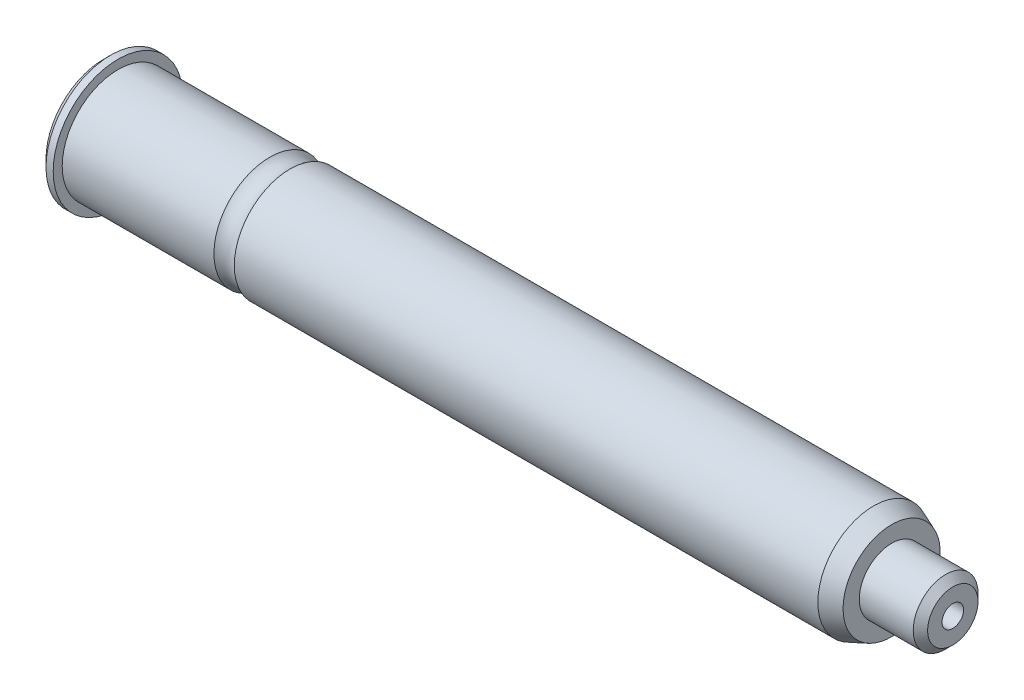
from build123d import *

# Parameters (mm, degrees)
CHANFREIN1_SIZE = 1
PER_AGE1_D      = 3
PER_AGE1_DEPTH  = 25
PER_AGE1_TIP    = 0.901290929


with BuildPart() as part:
    # Esquisse1 → Base-R_volution (revolve)
    with BuildSketch(Plane.XY, mode=Mode.PRIVATE) as base_r_volution_sk:
        with BuildLine():
            Line((0, 0), (0, -9))
            Line((0, -9), (2, -9))
            Line((2, -9), (2, -7.75))
            Line((2, -7.75), (23.085786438, -7.75))
            ThreePointArc((23.085786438, -7.75), (24.5, -7.25), (25.914213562, -7.75))
            Line((25.914213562, -7.75), (107, -7.75))
            Line((107, -7.75), (109.5, -6.75))
            Line((109.5, -6.75), (109.5, -4.5))
            Line((109.5, -4.5), (118, -4.5))
            Line((118, -4.5), (118, 0))
            Line((118, 0), (0, 0))
        make_face()
    revolve(base_r_volution_sk.sketch.rotate(Axis((-10, 0, 0), (1, 0, 0)), 270), axis=Axis((-10, 0, 0), (1, 0, 0)))

    # Chanfrein1
    chanfrein1_edges = [part.edges().sort_by_distance(p)[0] for p in [
        (0, 0, -9),
        (118, 0, -4.5),
    ]]
    chamfer(chanfrein1_edges, length=CHANFREIN1_SIZE)

    # Per_age1
    with Locations(Plane(origin=(118, 0, 0), x_dir=(0, 0, -1), z_dir=(1, 0, 0))):
        with Locations((0, 0)):
            Hole(PER_AGE1_D / 2, depth=PER_AGE1_DEPTH)
            with Locations((0, 0, -(PER_AGE1_DEPTH + PER_AGE1_TIP / 2))):  # 118° drill point
                Cone(0, PER_AGE1_D / 2, PER_AGE1_TIP, mode=Mode.SUBTRACT)


solid = part.part
